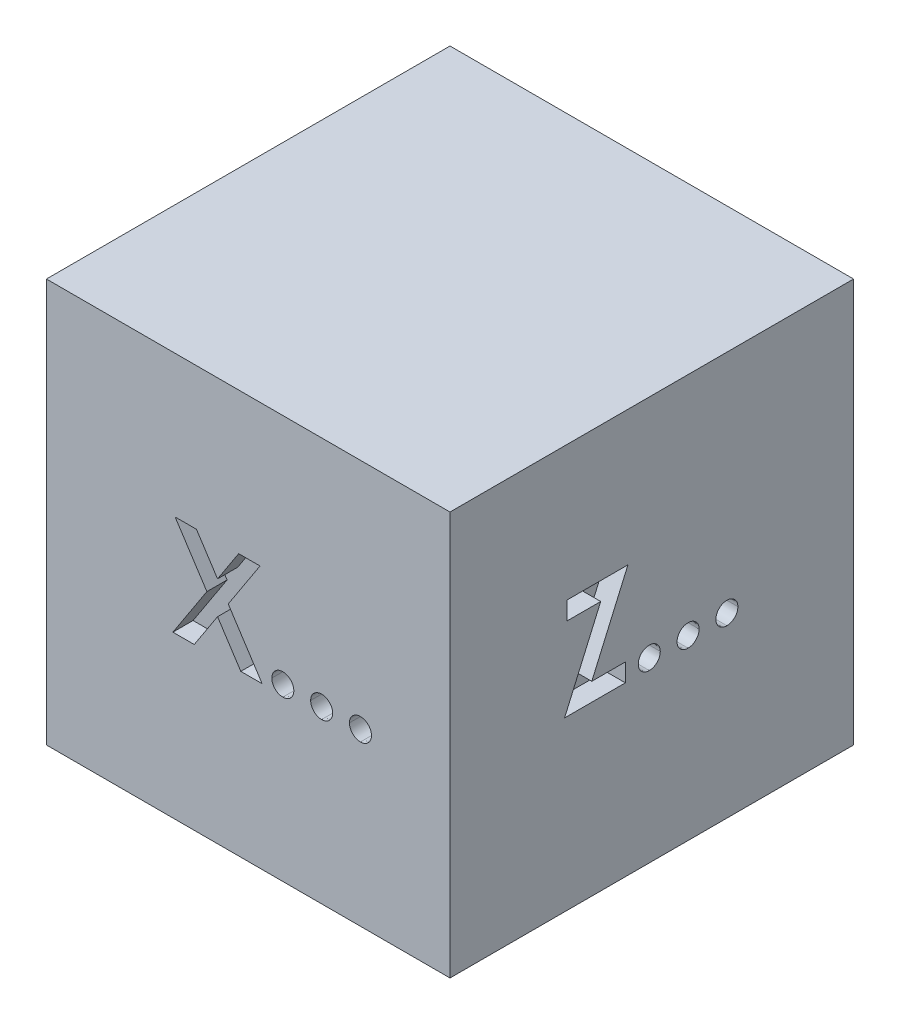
from build123d import *

# Parameters (mm, degrees)
SKETCH1_W           = 1
SKETCH1_H           = 1
BOSS_EXTRUDE1_DEPTH = 1
CUT_EXTRUDE1_DEPTH  = 0.05
CUT_EXTRUDE2_DEPTH  = 0.05
CUT_EXTRUDE3_DEPTH  = 0.05
CUT_EXTRUDE4_DEPTH  = 0.05
CUT_EXTRUDE5_DEPTH  = 0.05
CUT_EXTRUDE6_DEPTH  = 0.05
SKETCH9_W           = 0.654723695
SKETCH9_H           = 0.664450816
CUT_EXTRUDE8_DEPTH  = 0.8


with BuildPart() as part:
    # Sketch1 → Boss-Extrude1 (new body)
    with BuildSketch(Plane.XY):
        with Locations((0.5, 0.5)):
            Rectangle(SKETCH1_W, SKETCH1_H)
    extrude(amount=BOSS_EXTRUDE1_DEPTH)

    # Sketch2 → Cut-Extrude1 (cut)
    with BuildSketch(Plane(origin=(1, 0, 0), x_dir=(0, 0, -1), z_dir=(1, 0, 0))):
        Polygon((-0.709736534, 0.666133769), (-0.559095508, 0.666133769), (-0.648638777, 0.461005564), (-0.565505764, 0.461005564), (-0.565505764, 0.416133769), (-0.71614679, 0.416133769), (-0.626553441, 0.621261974), (-0.709736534, 0.621261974), align=None)
        with BuildLine():
            add(Edge.make_bspline(
                [(-0.506210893, 0.46741582), (-0.504399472, 0.467316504), (-0.500833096, 0.467120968), (-0.49568017, 0.465661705), (-0.491029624, 0.463039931), (-0.486871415, 0.459620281), (-0.483355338, 0.455505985), (-0.480813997, 0.450814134), (-0.479231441, 0.445681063), (-0.479056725, 0.442103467), (-0.478967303, 0.44027239)],
                knots=[0, 0, 0, 0, 1.016957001, 2.002212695, 2.9757545, 3.99499976, 5.013036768, 5.994806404, 6.97370641, 8, 8, 8, 8], degree=3))
            add(Edge.make_bspline(
                [(-0.478967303, 0.44027239), (-0.47905614, 0.43844102), (-0.47922971, 0.434862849), (-0.480824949, 0.429719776), (-0.483351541, 0.424989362), (-0.486871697, 0.420830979), (-0.491012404, 0.417346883), (-0.495690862, 0.414749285), (-0.50082328, 0.413207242), (-0.504397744, 0.413022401), (-0.506210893, 0.41292864)],
                knots=[0, 0, 0, 0, 1.023218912, 1.999186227, 2.986238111, 4.008388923, 5.030539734, 6.0011649, 6.986089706, 8, 8, 8, 8], degree=3))
            add(Edge.make_bspline(
                [(-0.506210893, 0.41292864), (-0.508024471, 0.413021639), (-0.511599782, 0.413204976), (-0.516740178, 0.414762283), (-0.521453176, 0.41732954), (-0.525594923, 0.420835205), (-0.529130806, 0.424974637), (-0.531585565, 0.429734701), (-0.533195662, 0.43486091), (-0.53336686, 0.438440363), (-0.533454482, 0.44027239)],
                knots=[0, 0, 0, 0, 1.013427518, 1.99788335, 2.976245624, 3.997909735, 5.019573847, 6.001765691, 6.977268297, 8, 8, 8, 8], degree=3))
            add(Edge.make_bspline(
                [(-0.533454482, 0.44027239), (-0.533366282, 0.442104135), (-0.533193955, 0.445683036), (-0.531596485, 0.450799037), (-0.529126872, 0.45552079), (-0.525595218, 0.459616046), (-0.521435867, 0.463057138), (-0.51675093, 0.465648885), (-0.511589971, 0.467123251), (-0.508022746, 0.467317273), (-0.506210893, 0.46741582)],
                knots=[0, 0, 0, 0, 1.025808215, 2.00424526, 2.981110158, 3.998665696, 5.017428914, 5.998734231, 6.983523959, 8, 8, 8, 8], degree=3))
        make_face()
        with BuildLine():
            add(Edge.make_bspline(
                [(-0.410057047, 0.46741582), (-0.408245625, 0.467316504), (-0.40467925, 0.467120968), (-0.399526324, 0.465661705), (-0.394875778, 0.463039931), (-0.390717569, 0.459620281), (-0.387201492, 0.455505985), (-0.384660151, 0.450814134), (-0.383077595, 0.445681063), (-0.382902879, 0.442103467), (-0.382813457, 0.44027239)],
                knots=[0, 0, 0, 0, 1.016957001, 2.002212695, 2.9757545, 3.99499976, 5.013036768, 5.994806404, 6.97370641, 8, 8, 8, 8], degree=3))
            add(Edge.make_bspline(
                [(-0.382813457, 0.44027239), (-0.382902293, 0.43844102), (-0.383075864, 0.434862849), (-0.384671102, 0.429719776), (-0.387197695, 0.424989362), (-0.390717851, 0.420830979), (-0.394858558, 0.417346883), (-0.399537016, 0.414749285), (-0.404669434, 0.413207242), (-0.408243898, 0.413022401), (-0.410057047, 0.41292864)],
                knots=[0, 0, 0, 0, 1.023218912, 1.999186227, 2.986238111, 4.008388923, 5.030539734, 6.0011649, 6.986089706, 8, 8, 8, 8], degree=3))
            add(Edge.make_bspline(
                [(-0.410057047, 0.41292864), (-0.411870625, 0.413021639), (-0.415445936, 0.413204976), (-0.420586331, 0.414762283), (-0.42529933, 0.41732954), (-0.429441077, 0.420835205), (-0.43297696, 0.424974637), (-0.435431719, 0.429734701), (-0.437041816, 0.43486091), (-0.437213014, 0.438440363), (-0.437300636, 0.44027239)],
                knots=[0, 0, 0, 0, 1.013427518, 1.99788335, 2.976245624, 3.997909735, 5.019573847, 6.001765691, 6.977268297, 8, 8, 8, 8], degree=3))
            add(Edge.make_bspline(
                [(-0.437300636, 0.44027239), (-0.437212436, 0.442104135), (-0.437040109, 0.445683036), (-0.435442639, 0.450799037), (-0.432973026, 0.45552079), (-0.429441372, 0.459616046), (-0.425282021, 0.463057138), (-0.420597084, 0.465648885), (-0.415436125, 0.467123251), (-0.411868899, 0.467317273), (-0.410057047, 0.46741582)],
                knots=[0, 0, 0, 0, 1.025808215, 2.00424526, 2.981110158, 3.998665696, 5.017428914, 5.998734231, 6.983523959, 8, 8, 8, 8], degree=3))
        make_face()
        with BuildLine():
            add(Edge.make_bspline(
                [(-0.3139032, 0.46741582), (-0.312091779, 0.467316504), (-0.308525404, 0.467120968), (-0.303372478, 0.465661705), (-0.298721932, 0.463039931), (-0.294563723, 0.459620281), (-0.291047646, 0.455505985), (-0.288506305, 0.450814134), (-0.286923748, 0.445681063), (-0.286749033, 0.442103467), (-0.286659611, 0.44027239)],
                knots=[0, 0, 0, 0, 1.016957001, 2.002212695, 2.9757545, 3.99499976, 5.013036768, 5.994806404, 6.97370641, 8, 8, 8, 8], degree=3))
            add(Edge.make_bspline(
                [(-0.286659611, 0.44027239), (-0.286748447, 0.43844102), (-0.286922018, 0.434862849), (-0.288517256, 0.429719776), (-0.291043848, 0.424989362), (-0.294564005, 0.420830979), (-0.298704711, 0.417346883), (-0.30338317, 0.414749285), (-0.308515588, 0.413207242), (-0.312090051, 0.413022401), (-0.3139032, 0.41292864)],
                knots=[0, 0, 0, 0, 1.023218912, 1.999186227, 2.986238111, 4.008388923, 5.030539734, 6.0011649, 6.986089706, 8, 8, 8, 8], degree=3))
            add(Edge.make_bspline(
                [(-0.3139032, 0.41292864), (-0.315716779, 0.413021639), (-0.31929209, 0.413204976), (-0.324432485, 0.414762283), (-0.329145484, 0.41732954), (-0.333287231, 0.420835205), (-0.336823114, 0.424974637), (-0.339277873, 0.429734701), (-0.34088797, 0.43486091), (-0.341059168, 0.438440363), (-0.34114679, 0.44027239)],
                knots=[0, 0, 0, 0, 1.013427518, 1.99788335, 2.976245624, 3.997909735, 5.019573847, 6.001765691, 6.977268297, 8, 8, 8, 8], degree=3))
            add(Edge.make_bspline(
                [(-0.34114679, 0.44027239), (-0.34105859, 0.442104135), (-0.340886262, 0.445683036), (-0.339288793, 0.450799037), (-0.33681918, 0.45552079), (-0.333287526, 0.459616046), (-0.329128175, 0.463057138), (-0.324443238, 0.465648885), (-0.319282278, 0.467123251), (-0.315715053, 0.467317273), (-0.3139032, 0.46741582)],
                knots=[0, 0, 0, 0, 1.025808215, 2.00424526, 2.981110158, 3.998665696, 5.017428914, 5.998734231, 6.983523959, 8, 8, 8, 8], degree=3))
        make_face()
    extrude(amount=-CUT_EXTRUDE1_DEPTH, mode=Mode.SUBTRACT)

    # Sketch3 → Cut-Extrude2 (cut)
    with BuildSketch(Plane.XY.offset(1)):
        Polygon((0.318905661, 0.648808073), (0.371790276, 0.648808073), (0.42402385, 0.568529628), (0.476357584, 0.648808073), (0.529292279, 0.648808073), (0.450466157, 0.527914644), (0.534500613, 0.398808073), (0.481615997, 0.398808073), (0.42402385, 0.48734974), (0.366281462, 0.398808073), (0.313346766, 0.398808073), (0.397581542, 0.527964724), align=None)
        with BuildLine():
            add(Edge.make_bspline(
                [(0.585782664, 0.450090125), (0.587594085, 0.449990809), (0.59116046, 0.449795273), (0.596313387, 0.44833601), (0.600963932, 0.445714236), (0.605122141, 0.442294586), (0.608638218, 0.43818029), (0.611179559, 0.433488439), (0.612762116, 0.428355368), (0.612936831, 0.424777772), (0.613026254, 0.422946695)],
                knots=[0, 0, 0, 0, 1.016957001, 2.002212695, 2.9757545, 3.99499976, 5.013036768, 5.994806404, 6.97370641, 8, 8, 8, 8], degree=3))
            add(Edge.make_bspline(
                [(0.613026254, 0.422946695), (0.612937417, 0.421115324), (0.612763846, 0.417537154), (0.611168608, 0.412394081), (0.608642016, 0.407663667), (0.605121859, 0.403505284), (0.600981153, 0.400021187), (0.596302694, 0.39742359), (0.591170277, 0.395881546), (0.587595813, 0.395696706), (0.585782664, 0.395602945)],
                knots=[0, 0, 0, 0, 1.023218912, 1.999186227, 2.986238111, 4.008388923, 5.030539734, 6.0011649, 6.986089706, 8, 8, 8, 8], degree=3))
            add(Edge.make_bspline(
                [(0.585782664, 0.395602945), (0.583969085, 0.395695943), (0.580393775, 0.395879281), (0.575253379, 0.397436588), (0.57054038, 0.400003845), (0.566398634, 0.40350951), (0.562862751, 0.407648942), (0.560407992, 0.412409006), (0.558797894, 0.417535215), (0.558626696, 0.421114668), (0.558539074, 0.422946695)],
                knots=[0, 0, 0, 0, 1.013427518, 1.99788335, 2.976245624, 3.997909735, 5.019573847, 6.001765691, 6.977268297, 8, 8, 8, 8], degree=3))
            add(Edge.make_bspline(
                [(0.558539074, 0.422946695), (0.558627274, 0.42477844), (0.558799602, 0.42835734), (0.560397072, 0.433473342), (0.562866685, 0.438195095), (0.566398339, 0.442290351), (0.57055769, 0.445731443), (0.575242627, 0.44832319), (0.580403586, 0.449797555), (0.583970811, 0.449991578), (0.585782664, 0.450090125)],
                knots=[0, 0, 0, 0, 1.025808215, 2.00424526, 2.981110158, 3.998665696, 5.017428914, 5.998734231, 6.983523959, 8, 8, 8, 8], degree=3))
        make_face()
        with BuildLine():
            add(Edge.make_bspline(
                [(0.68193651, 0.450090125), (0.683747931, 0.449990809), (0.687314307, 0.449795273), (0.692467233, 0.44833601), (0.697117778, 0.445714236), (0.701275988, 0.442294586), (0.704792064, 0.43818029), (0.707333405, 0.433488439), (0.708915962, 0.428355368), (0.709090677, 0.424777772), (0.7091801, 0.422946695)],
                knots=[0, 0, 0, 0, 1.016957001, 2.002212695, 2.9757545, 3.99499976, 5.013036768, 5.994806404, 6.97370641, 8, 8, 8, 8], degree=3))
            add(Edge.make_bspline(
                [(0.7091801, 0.422946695), (0.709091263, 0.421115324), (0.708917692, 0.417537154), (0.707322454, 0.412394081), (0.704795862, 0.407663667), (0.701275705, 0.403505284), (0.697134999, 0.400021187), (0.69245654, 0.39742359), (0.687324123, 0.395881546), (0.683749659, 0.395696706), (0.68193651, 0.395602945)],
                knots=[0, 0, 0, 0, 1.023218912, 1.999186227, 2.986238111, 4.008388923, 5.030539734, 6.0011649, 6.986089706, 8, 8, 8, 8], degree=3))
            add(Edge.make_bspline(
                [(0.68193651, 0.395602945), (0.680122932, 0.395695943), (0.676547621, 0.395879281), (0.671407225, 0.397436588), (0.666694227, 0.400003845), (0.66255248, 0.40350951), (0.659016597, 0.407648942), (0.656561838, 0.412409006), (0.65495174, 0.417535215), (0.654780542, 0.421114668), (0.65469292, 0.422946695)],
                knots=[0, 0, 0, 0, 1.013427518, 1.99788335, 2.976245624, 3.997909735, 5.019573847, 6.001765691, 6.977268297, 8, 8, 8, 8], degree=3))
            add(Edge.make_bspline(
                [(0.65469292, 0.422946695), (0.654781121, 0.42477844), (0.654953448, 0.42835734), (0.656550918, 0.433473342), (0.659020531, 0.438195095), (0.662552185, 0.442290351), (0.666711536, 0.445731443), (0.671396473, 0.44832319), (0.676557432, 0.449797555), (0.680124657, 0.449991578), (0.68193651, 0.450090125)],
                knots=[0, 0, 0, 0, 1.025808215, 2.00424526, 2.981110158, 3.998665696, 5.017428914, 5.998734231, 6.983523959, 8, 8, 8, 8], degree=3))
        make_face()
        with BuildLine():
            add(Edge.make_bspline(
                [(0.778090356, 0.450090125), (0.779901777, 0.449990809), (0.783468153, 0.449795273), (0.788621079, 0.44833601), (0.793271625, 0.445714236), (0.797429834, 0.442294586), (0.800945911, 0.43818029), (0.803487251, 0.433488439), (0.805069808, 0.428355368), (0.805244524, 0.424777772), (0.805333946, 0.422946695)],
                knots=[0, 0, 0, 0, 1.016957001, 2.002212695, 2.9757545, 3.99499976, 5.013036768, 5.994806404, 6.97370641, 8, 8, 8, 8], degree=3))
            add(Edge.make_bspline(
                [(0.805333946, 0.422946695), (0.805245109, 0.421115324), (0.805071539, 0.417537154), (0.8034763, 0.412394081), (0.800949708, 0.407663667), (0.797429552, 0.403505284), (0.793288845, 0.400021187), (0.788610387, 0.39742359), (0.783477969, 0.395881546), (0.779903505, 0.395696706), (0.778090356, 0.395602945)],
                knots=[0, 0, 0, 0, 1.023218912, 1.999186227, 2.986238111, 4.008388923, 5.030539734, 6.0011649, 6.986089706, 8, 8, 8, 8], degree=3))
            add(Edge.make_bspline(
                [(0.778090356, 0.395602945), (0.776276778, 0.395695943), (0.772701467, 0.395879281), (0.767561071, 0.397436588), (0.762848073, 0.400003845), (0.758706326, 0.40350951), (0.755170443, 0.407648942), (0.752715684, 0.412409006), (0.751105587, 0.417535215), (0.750934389, 0.421114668), (0.750846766, 0.422946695)],
                knots=[0, 0, 0, 0, 1.013427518, 1.99788335, 2.976245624, 3.997909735, 5.019573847, 6.001765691, 6.977268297, 8, 8, 8, 8], degree=3))
            add(Edge.make_bspline(
                [(0.750846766, 0.422946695), (0.750934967, 0.42477844), (0.751107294, 0.42835734), (0.752704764, 0.433473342), (0.755174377, 0.438195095), (0.758706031, 0.442290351), (0.762865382, 0.445731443), (0.767550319, 0.44832319), (0.772711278, 0.449797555), (0.776278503, 0.449991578), (0.778090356, 0.450090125)],
                knots=[0, 0, 0, 0, 1.025808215, 2.00424526, 2.981110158, 3.998665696, 5.017428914, 5.998734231, 6.983523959, 8, 8, 8, 8], degree=3))
        make_face()
    extrude(amount=-CUT_EXTRUDE2_DEPTH, mode=Mode.SUBTRACT)

    # Sketch4 → Cut-Extrude3 (cut)
    with BuildSketch(Plane.ZY):
        Polygon((0.393768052, 0.300924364), (0.393768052, 0.32661547), (0.501189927, 0.392320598), (0.393768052, 0.457925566), (0.393768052, 0.483616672), (0.524927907, 0.403488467), (0.643768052, 0.403488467), (0.643768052, 0.381052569), (0.524927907, 0.381052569), align=None)
    extrude(amount=-CUT_EXTRUDE3_DEPTH, mode=Mode.SUBTRACT)

    # Sketch5 → Cut-Extrude4 (cut)
    with BuildSketch(Plane.ZY):
        with BuildLine():
            add(Edge.make_bspline(
                [(0.626601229, 0.482979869), (0.627993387, 0.482897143), (0.63072255, 0.482734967), (0.634668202, 0.481622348), (0.638239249, 0.479646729), (0.641420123, 0.477013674), (0.644042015, 0.473821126), (0.64608804, 0.470278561), (0.647190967, 0.466299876), (0.647351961, 0.463554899), (0.647434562, 0.462146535)],
                knots=[0, 0, 0, 0, 1.020151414, 1.999887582, 2.974338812, 3.990962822, 5.007586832, 5.987933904, 6.967670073, 8, 8, 8, 8], degree=3))
            add(Edge.make_bspline(
                [(0.647434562, 0.462146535), (0.647349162, 0.460772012), (0.647180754, 0.458061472), (0.646090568, 0.454112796), (0.644026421, 0.450568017), (0.641438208, 0.44733215), (0.638238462, 0.444693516), (0.634659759, 0.442734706), (0.630731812, 0.441542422), (0.627994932, 0.441390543), (0.626601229, 0.441313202)],
                knots=[0, 0, 0, 0, 1.009421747, 1.99056486, 2.972319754, 3.999869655, 5.017953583, 5.993804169, 6.978383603, 8, 8, 8, 8], degree=3))
            add(Edge.make_bspline(
                [(0.626601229, 0.441313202), (0.625206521, 0.441387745), (0.622483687, 0.441533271), (0.618570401, 0.442759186), (0.614969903, 0.444675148), (0.611770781, 0.44733707), (0.60916089, 0.450551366), (0.607187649, 0.454137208), (0.606002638, 0.458050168), (0.60584679, 0.460769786), (0.605767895, 0.462146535)],
                knots=[0, 0, 0, 0, 1.022052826, 1.995314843, 2.982371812, 4.00089066, 5.028879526, 6.005146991, 6.990147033, 8, 8, 8, 8], degree=3))
            add(Edge.make_bspline(
                [(0.605767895, 0.462146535), (0.605843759, 0.463557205), (0.605991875, 0.466311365), (0.607190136, 0.470254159), (0.60914558, 0.473837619), (0.611788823, 0.477008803), (0.61496913, 0.479665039), (0.618561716, 0.481598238), (0.622493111, 0.482743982), (0.625208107, 0.482899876), (0.626601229, 0.482979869)],
                knots=[0, 0, 0, 0, 1.032775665, 2.016367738, 2.991239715, 4.008302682, 5.025365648, 6.011011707, 6.979408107, 8, 8, 8, 8], degree=3))
        make_face()
    extrude(amount=-CUT_EXTRUDE4_DEPTH, mode=Mode.SUBTRACT)

    # Sketch6 → Cut-Extrude5 (cut)
    with BuildSketch(Plane.ZY):
        with BuildLine():
            add(Edge.make_bspline(
                [(0.625238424, 0.546786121), (0.626630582, 0.546703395), (0.629359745, 0.54654122), (0.633305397, 0.545428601), (0.636876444, 0.543452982), (0.640057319, 0.540819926), (0.64267921, 0.537627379), (0.644725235, 0.534084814), (0.645828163, 0.530106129), (0.645989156, 0.527361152), (0.646071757, 0.525952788)],
                knots=[0, 0, 0, 0, 1.020151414, 1.999887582, 2.974338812, 3.990962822, 5.007586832, 5.987933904, 6.967670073, 8, 8, 8, 8], degree=3))
            add(Edge.make_bspline(
                [(0.646071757, 0.525952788), (0.645986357, 0.524578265), (0.64581795, 0.521867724), (0.644727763, 0.517919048), (0.642663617, 0.51437427), (0.640075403, 0.511138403), (0.636875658, 0.508499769), (0.633296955, 0.506540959), (0.629369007, 0.505348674), (0.626632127, 0.505196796), (0.625238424, 0.505119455)],
                knots=[0, 0, 0, 0, 1.009421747, 1.99056486, 2.972319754, 3.999869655, 5.017953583, 5.993804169, 6.978383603, 8, 8, 8, 8], degree=3))
            add(Edge.make_bspline(
                [(0.625238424, 0.505119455), (0.623843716, 0.505193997), (0.621120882, 0.505339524), (0.617207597, 0.506565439), (0.613607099, 0.5084814), (0.610407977, 0.511143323), (0.607798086, 0.514357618), (0.605824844, 0.517943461), (0.604639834, 0.521856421), (0.604483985, 0.524576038), (0.604405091, 0.525952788)],
                knots=[0, 0, 0, 0, 1.022052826, 1.995314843, 2.982371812, 4.00089066, 5.028879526, 6.005146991, 6.990147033, 8, 8, 8, 8], degree=3))
            add(Edge.make_bspline(
                [(0.604405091, 0.525952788), (0.604480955, 0.527363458), (0.60462907, 0.530117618), (0.605827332, 0.534060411), (0.607782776, 0.537643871), (0.610426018, 0.540815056), (0.613606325, 0.543471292), (0.617198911, 0.545404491), (0.621130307, 0.546550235), (0.623845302, 0.546706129), (0.625238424, 0.546786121)],
                knots=[0, 0, 0, 0, 1.032775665, 2.016367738, 2.991239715, 4.008302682, 5.025365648, 6.011011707, 6.979408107, 8, 8, 8, 8], degree=3))
        make_face()
    extrude(amount=-CUT_EXTRUDE5_DEPTH, mode=Mode.SUBTRACT)

    # Sketch7 → Cut-Extrude6 (cut)
    with BuildSketch(Plane.ZY):
        with BuildLine():
            add(Edge.make_bspline(
                [(0.624889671, 0.610774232), (0.626281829, 0.610691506), (0.629010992, 0.610529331), (0.632956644, 0.609416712), (0.636527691, 0.607441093), (0.639708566, 0.604808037), (0.642330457, 0.60161549), (0.644376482, 0.598072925), (0.645479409, 0.59409424), (0.645640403, 0.591349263), (0.645723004, 0.589940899)],
                knots=[0, 0, 0, 0, 1.020151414, 1.999887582, 2.974338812, 3.990962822, 5.007586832, 5.987933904, 6.967670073, 8, 8, 8, 8], degree=3))
            add(Edge.make_bspline(
                [(0.645723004, 0.589940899), (0.645637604, 0.588566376), (0.645469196, 0.585855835), (0.64437901, 0.581907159), (0.642314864, 0.57836238), (0.63972665, 0.575126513), (0.636526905, 0.57248788), (0.632948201, 0.57052907), (0.629020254, 0.569336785), (0.626283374, 0.569184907), (0.624889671, 0.569107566)],
                knots=[0, 0, 0, 0, 1.009421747, 1.99056486, 2.972319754, 3.999869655, 5.017953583, 5.993804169, 6.978383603, 8, 8, 8, 8], degree=3))
            add(Edge.make_bspline(
                [(0.624889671, 0.569107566), (0.623494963, 0.569182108), (0.620772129, 0.569327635), (0.616858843, 0.57055355), (0.613258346, 0.572469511), (0.610059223, 0.575131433), (0.607449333, 0.578345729), (0.605476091, 0.581931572), (0.60429108, 0.585844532), (0.604135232, 0.588564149), (0.604056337, 0.589940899)],
                knots=[0, 0, 0, 0, 1.022052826, 1.995314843, 2.982371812, 4.00089066, 5.028879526, 6.005146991, 6.990147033, 8, 8, 8, 8], degree=3))
            add(Edge.make_bspline(
                [(0.604056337, 0.589940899), (0.604132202, 0.591351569), (0.604280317, 0.594105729), (0.605478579, 0.598048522), (0.607434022, 0.601631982), (0.610077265, 0.604803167), (0.613257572, 0.607459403), (0.616850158, 0.609392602), (0.620781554, 0.610538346), (0.623496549, 0.61069424), (0.624889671, 0.610774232)],
                knots=[0, 0, 0, 0, 1.032775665, 2.016367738, 2.991239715, 4.008302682, 5.025365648, 6.011011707, 6.979408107, 8, 8, 8, 8], degree=3))
        make_face()
    extrude(amount=-CUT_EXTRUDE6_DEPTH, mode=Mode.SUBTRACT)

    # Sketch9 → Cut-Extrude8 (cut)
    with BuildSketch(Plane(origin=(0, 0, 0), x_dir=(-1, 0, 0), z_dir=(0, 0, -1))):
        with Locations((-0.500403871, 0.504425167)):
            Rectangle(SKETCH9_W, SKETCH9_H)
    extrude(amount=-CUT_EXTRUDE8_DEPTH, mode=Mode.SUBTRACT)


solid = part.part
